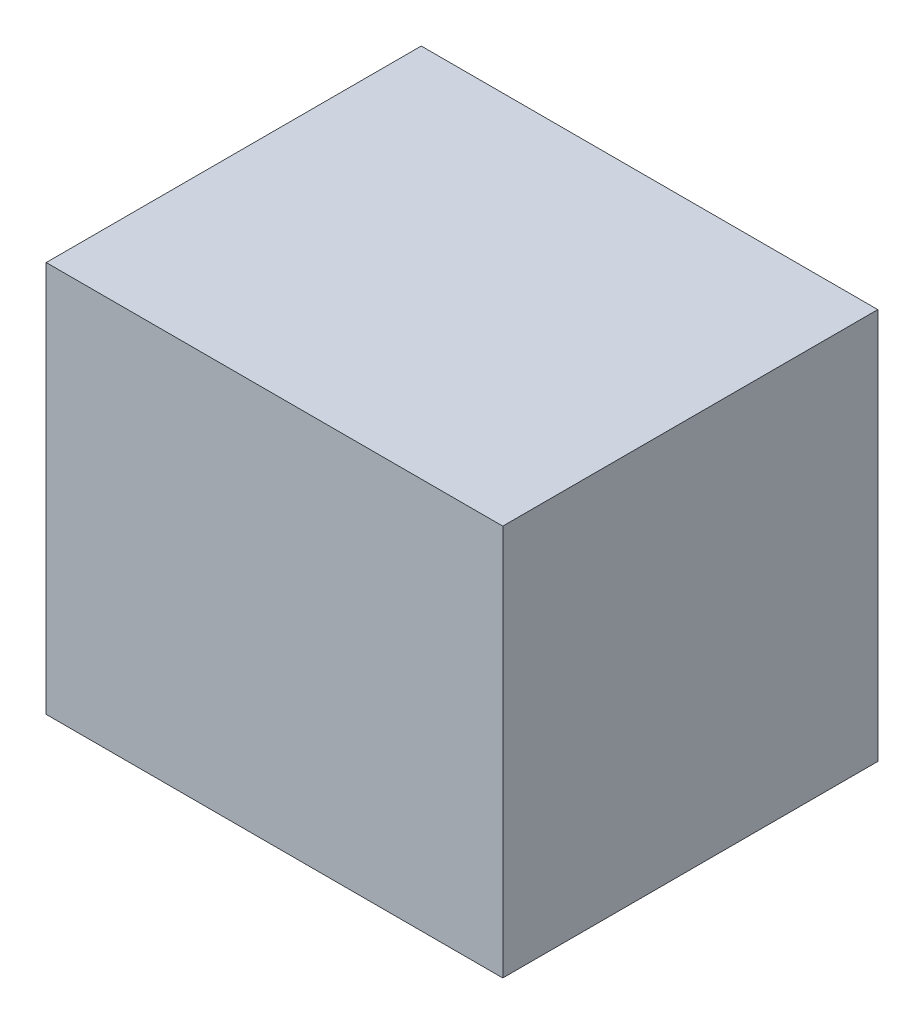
from build123d import *

# Parameters (mm, degrees)
ESQUISSE1_W        = 56
ESQUISSE1_H        = 46
BOSS_EXTRU_1_DEPTH = 48


with BuildPart() as part:
    # Esquisse1 → Boss.-Extru.1 (new body)
    with BuildSketch(Plane(origin=(0, -134.616874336, 0), x_dir=(1, 0, 0), z_dir=(0, 1, 0))):
        with Locations((63.584207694, -10.116711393)):
            Rectangle(ESQUISSE1_W, ESQUISSE1_H)
    extrude(amount=BOSS_EXTRU_1_DEPTH)


solid = part.part
